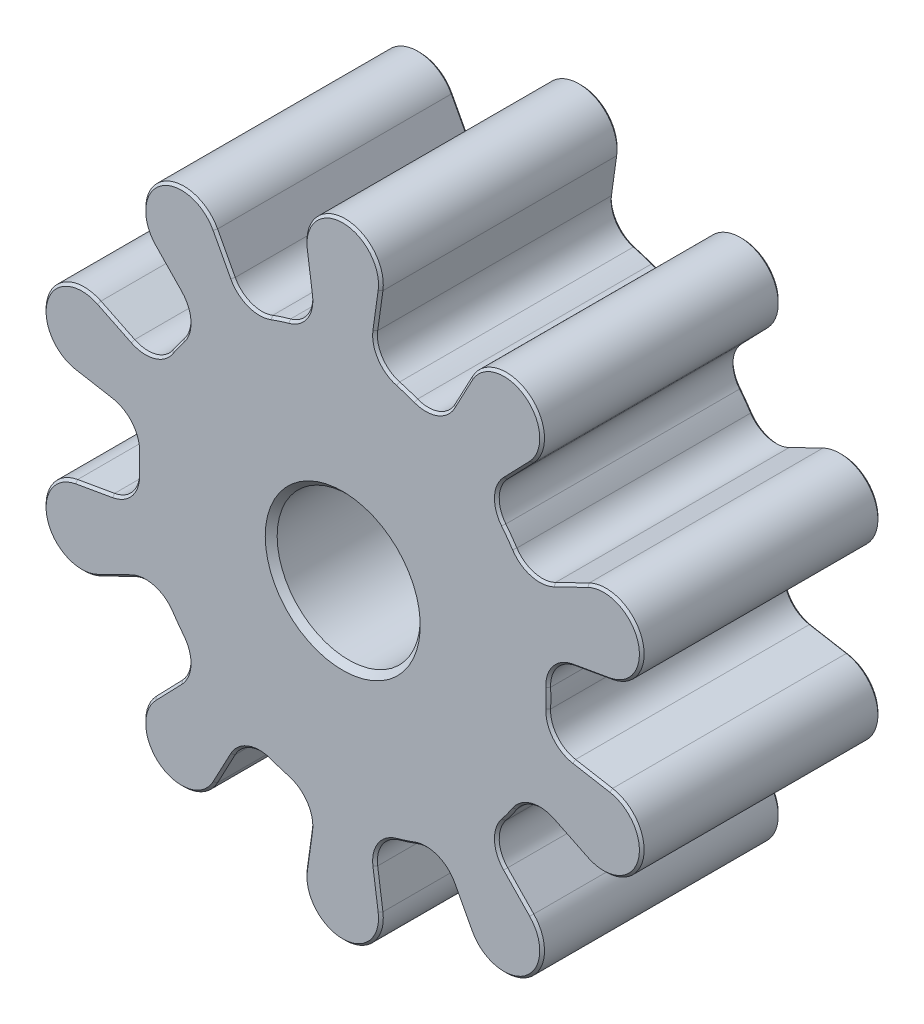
from build123d import *

# Parameters (mm, degrees)
SKETCH_1_R      = 3
EXTRUDE_1_DEPTH = 10
CHAMFER_1_SIZE  = 0.25
CHAMFER_2_SIZE  = 0.1


with BuildPart() as part:
    # Sketch 1 → Extrude 1 (new body)
    with BuildSketch(Plane.XY):
        with BuildLine():
            Line((-1.365309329, 9.717718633), (-1.584438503, 11.277391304))
            ThreePointArc((-1.584438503, 11.277391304), (0, 13.1), (1.584438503, 11.277391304))
            Line((1.584438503, 11.277391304), (1.365309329, 9.717718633))
            ThreePointArc((1.365309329, 9.717718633), (1.561669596, 8.843478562), (2.286306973, 8.3164551))
            ThreePointArc((2.286306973, 8.3164551), (2.665271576, 8.202862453), (3.038628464, 8.07201103))
            ThreePointArc((3.038628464, 8.07201103), (3.934649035, 8.072450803), (4.607373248, 8.66430821))
            Line((4.607373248, 8.66430821), (5.346846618, 10.054910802))
            ThreePointArc((5.346846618, 10.054910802), (7.699986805, 10.598122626), (7.910521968, 8.192291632))
            Line((7.910521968, 8.192291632), (6.816490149, 7.059290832))
            ThreePointArc((6.816490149, 7.059290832), (6.461483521, 6.236598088), (6.737950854, 5.384295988))
            ThreePointArc((6.737950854, 5.384295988), (6.977771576, 5.069647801), (7.202911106, 4.744333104))
            ThreePointArc((7.202911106, 4.744333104), (7.928065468, 4.218021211), (8.820195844, 4.301426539))
            Line((8.820195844, 4.301426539), (10.235818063, 4.991796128))
            ThreePointArc((10.235818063, 4.991796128), (12.458840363, 4.048122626), (11.215054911, 1.978015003))
            Line((11.215054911, 1.978015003), (9.664003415, 1.70445387))
            ThreePointArc((9.664003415, 1.70445387), (8.893230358, 1.247549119), (8.615926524, 0.395518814))
            ThreePointArc((8.615926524, 0.395518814), (8.625, 0), (8.615926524, -0.395518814))
            ThreePointArc((8.615926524, -0.395518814), (8.893230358, -1.247549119), (9.664003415, -1.70445387))
            Line((9.664003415, -1.70445387), (11.215054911, -1.978015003))
            ThreePointArc((11.215054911, -1.978015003), (12.458840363, -4.048122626), (10.235818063, -4.991796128))
            Line((10.235818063, -4.991796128), (8.820195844, -4.301426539))
            ThreePointArc((8.820195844, -4.301426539), (7.928065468, -4.218021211), (7.202911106, -4.744333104))
            ThreePointArc((7.202911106, -4.744333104), (6.977771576, -5.069647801), (6.737950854, -5.384295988))
            ThreePointArc((6.737950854, -5.384295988), (6.461483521, -6.236598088), (6.816490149, -7.059290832))
            Line((6.816490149, -7.059290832), (7.910521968, -8.192291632))
            ThreePointArc((7.910521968, -8.192291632), (7.699986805, -10.598122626), (5.346846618, -10.054910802))
            Line((5.346846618, -10.054910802), (4.607373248, -8.66430821))
            ThreePointArc((4.607373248, -8.66430821), (3.934649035, -8.072450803), (3.038628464, -8.07201103))
            ThreePointArc((3.038628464, -8.07201103), (2.665271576, -8.202862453), (2.286306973, -8.3164551))
            ThreePointArc((2.286306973, -8.3164551), (1.561669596, -8.843478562), (1.365309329, -9.717718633))
            Line((1.365309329, -9.717718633), (1.584438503, -11.277391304))
            ThreePointArc((1.584438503, -11.277391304), (0, -13.1), (-1.584438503, -11.277391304))
            Line((-1.584438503, -11.277391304), (-1.365309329, -9.717718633))
            ThreePointArc((-1.365309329, -9.717718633), (-1.561669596, -8.843478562), (-2.286306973, -8.3164551))
            ThreePointArc((-2.286306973, -8.3164551), (-2.665271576, -8.202862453), (-3.038628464, -8.07201103))
            ThreePointArc((-3.038628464, -8.07201103), (-3.934649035, -8.072450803), (-4.607373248, -8.66430821))
            Line((-4.607373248, -8.66430821), (-5.346846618, -10.054910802))
            ThreePointArc((-5.346846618, -10.054910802), (-7.699986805, -10.598122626), (-7.910521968, -8.192291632))
            Line((-7.910521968, -8.192291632), (-6.816490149, -7.059290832))
            ThreePointArc((-6.816490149, -7.059290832), (-6.461483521, -6.236598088), (-6.737950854, -5.384295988))
            ThreePointArc((-6.737950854, -5.384295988), (-6.977771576, -5.069647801), (-7.202911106, -4.744333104))
            ThreePointArc((-7.202911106, -4.744333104), (-7.928065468, -4.218021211), (-8.820195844, -4.301426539))
            Line((-8.820195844, -4.301426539), (-10.235818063, -4.991796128))
            ThreePointArc((-10.235818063, -4.991796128), (-12.458840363, -4.048122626), (-11.215054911, -1.978015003))
            Line((-11.215054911, -1.978015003), (-9.664003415, -1.70445387))
            ThreePointArc((-9.664003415, -1.70445387), (-8.893230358, -1.247549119), (-8.615926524, -0.395518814))
            ThreePointArc((-8.615926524, -0.395518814), (-8.625, 0), (-8.615926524, 0.395518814))
            ThreePointArc((-8.615926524, 0.395518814), (-8.893230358, 1.247549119), (-9.664003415, 1.70445387))
            Line((-9.664003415, 1.70445387), (-11.215054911, 1.978015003))
            ThreePointArc((-11.215054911, 1.978015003), (-12.458840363, 4.048122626), (-10.235818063, 4.991796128))
            Line((-10.235818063, 4.991796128), (-8.820195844, 4.301426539))
            ThreePointArc((-8.820195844, 4.301426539), (-7.928065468, 4.218021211), (-7.202911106, 4.744333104))
            ThreePointArc((-7.202911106, 4.744333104), (-6.977771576, 5.069647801), (-6.737950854, 5.384295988))
            ThreePointArc((-6.737950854, 5.384295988), (-6.461483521, 6.236598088), (-6.816490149, 7.059290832))
            Line((-6.816490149, 7.059290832), (-7.910521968, 8.192291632))
            ThreePointArc((-7.910521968, 8.192291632), (-7.699986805, 10.598122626), (-5.346846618, 10.054910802))
            Line((-5.346846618, 10.054910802), (-4.607373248, 8.66430821))
            ThreePointArc((-4.607373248, 8.66430821), (-3.934649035, 8.072450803), (-3.038628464, 8.07201103))
            ThreePointArc((-3.038628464, 8.07201103), (-2.665271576, 8.202862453), (-2.286306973, 8.3164551))
            ThreePointArc((-2.286306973, 8.3164551), (-1.561669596, 8.843478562), (-1.365309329, 9.717718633))
        make_face()
        Circle(SKETCH_1_R, mode=Mode.SUBTRACT)
    extrude(amount=EXTRUDE_1_DEPTH)

    # Chamfer 1
    chamfer_1_edges = [part.edges().sort_by_distance(p)[0] for p in [
        (-3, 0, 0),
        (-3, 0, 10),
    ]]
    chamfer(chamfer_1_edges, length=CHAMFER_1_SIZE)

    # Chamfer 2
    chamfer_2_edges = [part.edges().sort_by_distance(p)[0] for p in [
        (-7.928065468, 4.218021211, 10),
        (7.928065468, -4.218021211, 10),
        (9.528006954, -4.646611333, 10),
        (12.458840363, -4.048122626, 10),
        (10.439529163, -1.841234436, 10),
        (8.893230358, -1.247549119, 10),
        (8.625, 0, 10),
        (8.893230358, 1.247549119, 10),
        (10.439529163, 1.841234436, 10),
        (12.458840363, 4.048122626, 10),
        (9.528006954, 4.646611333, 10),
        (-9.528006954, 4.646611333, 10),
        (7.928065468, 4.218021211, 10),
        (6.977771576, 5.069647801, 10),
        (6.461483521, 6.236598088, 10),
        (7.363506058, 7.625791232, 10),
        (7.699986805, 10.598122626, 10),
        (4.977109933, 9.359609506, 10),
        (3.934649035, 8.072450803, 10),
        (2.665271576, 8.202862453, 10),
        (1.561669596, 8.843478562, 10),
        (1.474873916, 10.497554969, 10),
        (-12.458840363, 4.048122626, 10),
        (0, 13.1, 10),
        (-1.474873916, 10.497554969, 10),
        (-1.561669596, 8.843478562, 10),
        (-2.665271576, 8.202862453, 10),
        (-3.934649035, 8.072450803, 10),
        (-4.977109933, 9.359609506, 10),
        (-7.699986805, 10.598122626, 10),
        (-7.363506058, 7.625791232, 10),
        (-10.439529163, 1.841234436, 10),
        (-8.893230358, 1.247549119, 10),
        (-8.625, 0, 10),
        (-8.893230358, -1.247549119, 10),
        (-10.439529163, -1.841234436, 10),
        (-12.458840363, -4.048122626, 10),
        (-9.528006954, -4.646611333, 10),
        (-6.461483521, 6.236598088, 10),
        (-7.928065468, -4.218021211, 10),
        (-6.977771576, -5.069647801, 10),
        (-6.461483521, -6.236598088, 10),
        (-7.363506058, -7.625791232, 10),
        (-7.363506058, 7.625791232, 0),
        (-7.699986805, 10.598122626, 0),
        (-4.977109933, 9.359609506, 0),
        (-3.934649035, 8.072450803, 0),
        (-2.665271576, 8.202862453, 0),
        (-1.561669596, 8.843478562, 0),
        (-1.474873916, 10.497554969, 0),
        (-7.699986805, -10.598122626, 10),
        (0, 13.1, 0),
        (1.474873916, 10.497554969, 0),
        (1.561669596, 8.843478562, 0),
        (2.665271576, 8.202862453, 0),
        (3.934649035, 8.072450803, 0),
        (4.977109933, 9.359609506, 0),
        (7.699986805, 10.598122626, 0),
        (7.363506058, 7.625791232, 0),
        (-4.977109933, -9.359609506, 10),
        (6.461483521, 6.236598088, 0),
        (6.977771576, 5.069647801, 0),
        (7.928065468, 4.218021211, 0),
        (9.528006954, 4.646611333, 0),
        (12.458840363, 4.048122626, 0),
        (10.439529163, 1.841234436, 0),
        (8.893230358, 1.247549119, 0),
        (-3.934649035, -8.072450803, 10),
        (8.625, 0, 0),
        (8.893230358, -1.247549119, 0),
        (10.439529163, -1.841234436, 0),
        (12.458840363, -4.048122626, 0),
        (9.528006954, -4.646611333, 0),
        (7.928065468, -4.218021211, 0),
        (6.977771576, -5.069647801, 0),
        (6.461483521, -6.236598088, 0),
        (-2.665271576, -8.202862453, 10),
        (7.363506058, -7.625791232, 0),
        (7.699986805, -10.598122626, 0),
        (4.977109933, -9.359609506, 0),
        (3.934649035, -8.072450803, 0),
        (2.665271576, -8.202862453, 0),
        (1.561669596, -8.843478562, 0),
        (1.474873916, -10.497554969, 0),
        (-1.561669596, -8.843478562, 10),
        (0, -13.1, 0),
        (-1.474873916, -10.497554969, 0),
        (-1.561669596, -8.843478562, 0),
        (-2.665271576, -8.202862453, 0),
        (-3.934649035, -8.072450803, 0),
        (-4.977109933, -9.359609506, 0),
        (-7.699986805, -10.598122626, 0),
        (-7.363506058, -7.625791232, 0),
        (-1.474873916, -10.497554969, 10),
        (-6.461483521, -6.236598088, 0),
        (-6.977771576, -5.069647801, 0),
        (-7.928065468, -4.218021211, 0),
        (-9.528006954, -4.646611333, 0),
        (-12.458840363, -4.048122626, 0),
        (-10.439529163, -1.841234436, 0),
        (-8.893230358, -1.247549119, 0),
        (-6.977771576, 5.069647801, 10),
        (0, -13.1, 10),
        (-8.625, 0, 0),
        (-8.893230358, 1.247549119, 0),
        (-10.439529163, 1.841234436, 0),
        (-12.458840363, 4.048122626, 0),
        (-9.528006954, 4.646611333, 0),
        (-7.928065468, 4.218021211, 0),
        (-6.977771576, 5.069647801, 0),
        (-6.461483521, 6.236598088, 0),
        (1.474873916, -10.497554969, 10),
        (1.561669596, -8.843478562, 10),
        (2.665271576, -8.202862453, 10),
        (3.934649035, -8.072450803, 10),
        (4.977109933, -9.359609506, 10),
        (7.699986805, -10.598122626, 10),
        (7.363506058, -7.625791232, 10),
        (6.461483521, -6.236598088, 10),
        (6.977771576, -5.069647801, 10),
    ]]
    chamfer(chamfer_2_edges, length=CHAMFER_2_SIZE)


solid = part.part
